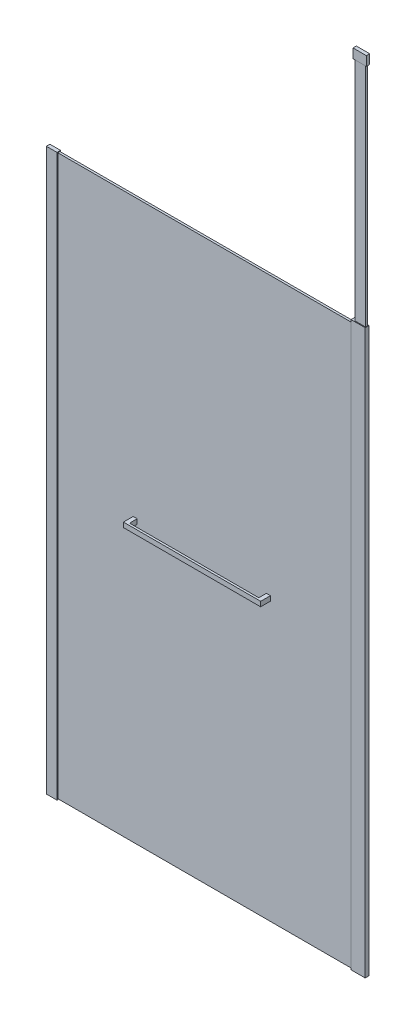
from build123d import *

# Parameters (mm, degrees)
DODANIE_WYCI_GNI_CIE1_START         = 3
DODANIE_WYCI_GNI_CIE1_DEPTH         = 2100
SZKIC2_W                            = 1147
SZKIC2_H                            = 8
DODANIE_WYCI_GNI_CIE2_DEPTH         = 2100
DODANIE_WYCI_GNI_CIE3_DEPTH         = 2108
SZKIC4_W                            = 40
SZKIC4_H                            = 13.3
DODANIE_WYCI_GNI_CIE4_DEPTH         = 3
SZKIC5_W                            = 53
SZKIC5_H                            = 14
DODANIE_WYCI_GNI_CIE5_DEPTH         = 3
SZKIC6_W                            = 8.1
SZKIC6_H                            = 7.8
DODANIE_WYCI_GNI_CIE6_DEPTH         = 15
SZKIC7_W                            = 53
SZKIC7_H                            = 14
DODANIE_WYCI_GNI_CIE7_DEPTH         = 3
SZKIC8_W                            = 40
SZKIC8_H                            = 13.3
DODANIE_WYCI_GNI_CIE8_DEPTH         = 3
SZKIC9_W                            = 40
SZKIC9_H                            = 8
DODANIE_WYCI_GNI_CIE9_DEPTH         = 883
DODANIE_WYCI_GNI_CIE10_START        = -32
SZKIC10_W                           = 50
SZKIC10_H                           = 12.5
DODANIE_WYCI_GNI_CIE10_DEPTH        = 35
DODANIE_WYCI_GNI_CIE11_DEPTH        = 36.5
DODANIE_WYCI_GNI_CIE11_DEPTH_BACK   = 18
SZKIC12_W                           = 15
SZKIC12_H                           = 18
DODANIE_WYCI_GNI_CIE11_2_DEPTH      = 36.5
DODANIE_WYCI_GNI_CIE11_2_DEPTH_BACK = 18
SZKIC13_W                           = 8
SZKIC13_H                           = 18
DODANIE_WYCI_GNI_CIE12_DEPTH        = 485


with BuildPart() as part:
    # Szkic1 → Dodanie-wyci_gni_cie1 (new body)
    with BuildSketch(Plane(origin=(0, 0, 0), x_dir=(1, 0, 0), z_dir=(0, 1, 0)).offset(DODANIE_WYCI_GNI_CIE1_START)):
        Polygon((0, 0), (0, 13.3), (40, 13.3), (40, 11.4), (6.5, 11.4), (6.5, 3.4), (40, 3.4), (40, 0), align=None)
    extrude(amount=DODANIE_WYCI_GNI_CIE1_DEPTH)

    # Szkic4 → Dodanie-wyci_gni_cie4 (add)
    with BuildSketch(Plane(origin=(0, 2103, 0), x_dir=(1, 0, 0), z_dir=(0, 1, 0))):
        with Locations((20, 6.65)):
            Rectangle(SZKIC4_W, SZKIC4_H)
    extrude(amount=DODANIE_WYCI_GNI_CIE4_DEPTH)

    # Szkic8 → Dodanie-wyci_gni_cie8 (add)
    with BuildSketch(Plane.XZ.offset(-3)):
        with Locations((20, -6.65)):
            Rectangle(SZKIC8_W, SZKIC8_H)
    extrude(amount=DODANIE_WYCI_GNI_CIE8_DEPTH)


with BuildPart() as body_2:
    # Szkic2 → Dodanie-wyci_gni_cie2 (new body)
    with BuildSketch(Plane.XZ.offset(-3)):
        with Locations((580, -7.4)):
            Rectangle(SZKIC2_W, SZKIC2_H)
    extrude(amount=-DODANIE_WYCI_GNI_CIE2_DEPTH)


with BuildPart() as body_3:
    # Szkic3 → Dodanie-wyci_gni_cie3 (new body)
    with BuildSketch(Plane.XZ.offset(-3)):
        Polygon((1143.4, -3.4), (1143.4, -0.4), (1196.4, -0.4), (1196.4, -14.4), (1143.4, -14.4), (1143.4, -11.4), (1153.5, -11.4), (1153.5, -3.4), align=None)
    extrude(amount=-DODANIE_WYCI_GNI_CIE3_DEPTH)

    # Szkic5 → Dodanie-wyci_gni_cie5 (add)
    with BuildSketch(Plane(origin=(0, 2111, 0), x_dir=(1, 0, 0), z_dir=(0, 1, 0))):
        with Locations((1169.9, 7.4)):
            Rectangle(SZKIC5_W, SZKIC5_H)
    extrude(amount=DODANIE_WYCI_GNI_CIE5_DEPTH)

    # Szkic6 → Dodanie-wyci_gni_cie6 (add)
    with BuildSketch(Plane.ZY.offset(-1143.4)):
        with Locations((-7.4, 2107.1)):
            Rectangle(SZKIC6_W, SZKIC6_H)
    extrude(amount=-DODANIE_WYCI_GNI_CIE6_DEPTH)

    # Szkic7 → Dodanie-wyci_gni_cie7 (add)
    with BuildSketch(Plane.XZ.offset(-3)):
        with Locations((1169.9, -7.4)):
            Rectangle(SZKIC7_W, SZKIC7_H)
    extrude(amount=DODANIE_WYCI_GNI_CIE7_DEPTH)


with BuildPart() as body_4:
    # Szkic9 → Dodanie-wyci_gni_cie9 (new body)
    with BuildSketch(Plane(origin=(0, 2114, 2099.6), x_dir=(-1, 0, 0), z_dir=(0, -1, 0))):
        with Locations((-1174.9, 2107)):
            Rectangle(SZKIC9_W, SZKIC9_H)
    extrude(amount=-DODANIE_WYCI_GNI_CIE9_DEPTH)

    # Szkic10 → Dodanie-wyci_gni_cie10 (add)
    with BuildSketch(Plane(origin=(0, 2997, 0), x_dir=(-1, 0, 0), z_dir=(0, 1, 0)).offset(DODANIE_WYCI_GNI_CIE10_START)):
        with Locations((-1174.9, -7.4)):
            Rectangle(SZKIC10_W, SZKIC10_H)
    extrude(amount=DODANIE_WYCI_GNI_CIE10_DEPTH)


with BuildPart() as body_5:
    # Szkic12 → Dodanie-wyci_gni_cie11 (new, two sides: drawn at the far end of the back side and taken through both)
    with BuildSketch(Plane.XY.offset(-3.4).offset(-DODANIE_WYCI_GNI_CIE11_DEPTH_BACK)):
        with Locations((330, 1053)):
            Rectangle(SZKIC12_W, SZKIC12_H)
    extrude(amount=DODANIE_WYCI_GNI_CIE11_DEPTH + DODANIE_WYCI_GNI_CIE11_DEPTH_BACK)



with BuildPart() as body_6:
    # Szkic12 → Dodanie-wyci_gni_cie11 2 (new, two sides: drawn at the far end of the back side and taken through both)
    with BuildSketch(Plane.XY.offset(-3.4).offset(-DODANIE_WYCI_GNI_CIE11_2_DEPTH_BACK)):
        with Locations((830, 1053)):
            Rectangle(SZKIC12_W, SZKIC12_H)
    extrude(amount=DODANIE_WYCI_GNI_CIE11_2_DEPTH + DODANIE_WYCI_GNI_CIE11_2_DEPTH_BACK)


with BuildPart() as body_5_1:
    add(body_5.part)

    add(body_6.part)  # Dodanie-wyci_gni_cie12 merges body 6
    # Szkic13 → Dodanie-wyci_gni_cie12 (add)
    with BuildSketch(Plane(origin=(337.5, 0, 0), x_dir=(0, 0, -1), z_dir=(1, 0, 0))):
        with Locations((-29.1, 1053)):
            Rectangle(SZKIC13_W, SZKIC13_H)
    extrude(amount=DODANIE_WYCI_GNI_CIE12_DEPTH)


solid = Compound([part.part, body_2.part, body_3.part, body_4.part, body_5_1.part])
